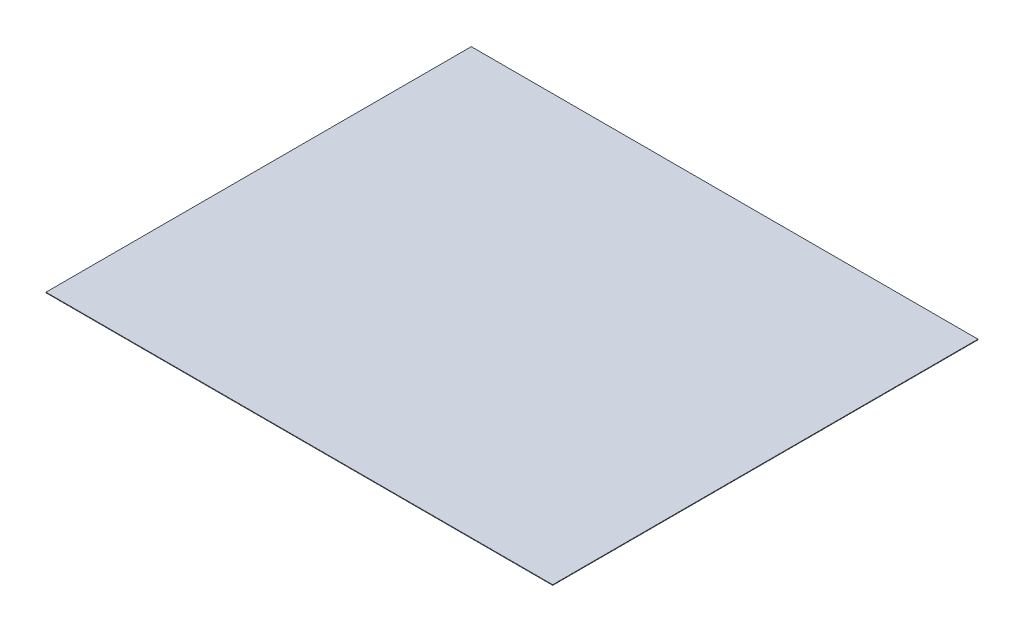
ISO-10303-21;
HEADER;
FILE_DESCRIPTION(('STEP AP214'),'2;1');
FILE_NAME('part.step','',(''),(''),'','','');
FILE_SCHEMA(('AUTOMOTIVE_DESIGN { 1 0 10303 214 1 1 1 1 }'));
ENDSEC;
DATA;
#1=APPLICATION_CONTEXT('core data for automotive mechanical design processes');
#2=APPLICATION_PROTOCOL_DEFINITION('international standard','automotive_design',2000,#1);
#3=PRODUCT_CONTEXT('',#1,'mechanical');
#4=PRODUCT('Part','Part','',(#3));
#5=PRODUCT_RELATED_PRODUCT_CATEGORY('part','',(#4));
#6=PRODUCT_DEFINITION_FORMATION('','',#4);
#7=PRODUCT_DEFINITION_CONTEXT('part definition',#1,'design');
#8=PRODUCT_DEFINITION('design','',#6,#7);
#9=PRODUCT_DEFINITION_SHAPE('','',#8);
#10=(LENGTH_UNIT() NAMED_UNIT(*) SI_UNIT(.MILLI.,.METRE.));
#11=(NAMED_UNIT(*) PLANE_ANGLE_UNIT() SI_UNIT($,.RADIAN.));
#12=(NAMED_UNIT(*) SI_UNIT($,.STERADIAN.) SOLID_ANGLE_UNIT());
#13=UNCERTAINTY_MEASURE_WITH_UNIT(LENGTH_MEASURE(1.E-05),#10,'distance_accuracy_value','');
#14=(GEOMETRIC_REPRESENTATION_CONTEXT(3) GLOBAL_UNCERTAINTY_ASSIGNED_CONTEXT((#13)) GLOBAL_UNIT_ASSIGNED_CONTEXT((#10,
#11,#12)) REPRESENTATION_CONTEXT('',''));
#15=CARTESIAN_POINT('',(0.,0.,0.));
#16=DIRECTION('',(0.,0.,1.));
#17=DIRECTION('',(1.,0.,0.));
#18=AXIS2_PLACEMENT_3D('',#15,#16,#17);
#19=CARTESIAN_POINT('',(-46547.8080775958,-100.,41093.7965483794));
#20=DIRECTION('',(-1.,0.,0.));
#21=DIRECTION('',(0.,0.,1.));
#22=AXIS2_PLACEMENT_3D('',#19,#20,#21);
#23=PLANE('',#22);
#24=DIRECTION('',(0.,0.,1.));
#25=VECTOR('',#24,1.);
#26=CARTESIAN_POINT('',(-46547.8080775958,0.,41093.7965483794));
#27=LINE('',#26,#25);
#28=CARTESIAN_POINT('',(-46547.8080775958,0.,-34760.7804493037));
#29=VERTEX_POINT('',#28);
#30=CARTESIAN_POINT('',(-46547.8080775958,0.,41093.7965483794));
#31=VERTEX_POINT('',#30);
#32=EDGE_CURVE('E103',#29,#31,#27,.T.);
#33=ORIENTED_EDGE('',*,*,#32,.F.);
#34=DIRECTION('',(0.,1.,0.));
#35=VECTOR('',#34,1.);
#36=CARTESIAN_POINT('',(-46547.8080775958,-100.,-34760.7804493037));
#37=LINE('',#36,#35);
#38=CARTESIAN_POINT('',(-46547.8080775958,-100.,-34760.7804493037));
#39=VERTEX_POINT('',#38);
#40=EDGE_CURVE('E11',#39,#29,#37,.T.);
#41=ORIENTED_EDGE('',*,*,#40,.F.);
#42=DIRECTION('',(0.,0.,1.));
#43=VECTOR('',#42,1.);
#44=CARTESIAN_POINT('',(-46547.8080775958,-100.,41093.7965483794));
#45=LINE('',#44,#43);
#46=CARTESIAN_POINT('',(-46547.8080775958,-100.,41093.7965483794));
#47=VERTEX_POINT('',#46);
#48=EDGE_CURVE('E97',#39,#47,#45,.T.);
#49=ORIENTED_EDGE('',*,*,#48,.T.);
#50=DIRECTION('',(0.,1.,0.));
#51=VECTOR('',#50,1.);
#52=CARTESIAN_POINT('',(-46547.8080775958,-100.,41093.7965483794));
#53=LINE('',#52,#51);
#54=EDGE_CURVE('E42',#47,#31,#53,.T.);
#55=ORIENTED_EDGE('',*,*,#54,.T.);
#56=EDGE_LOOP('',(#33,#41,#49,#55));
#57=FACE_BOUND('',#56,.T.);
#58=ADVANCED_FACE('F39',(#57),#23,.T.);
#59=CARTESIAN_POINT('',(-46547.8080775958,-100.,-34760.7804493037));
#60=DIRECTION('',(0.,0.,-1.));
#61=DIRECTION('',(-1.,0.,0.));
#62=AXIS2_PLACEMENT_3D('',#59,#60,#61);
#63=PLANE('',#62);
#64=DIRECTION('',(-1.,0.,0.));
#65=VECTOR('',#64,1.);
#66=CARTESIAN_POINT('',(-46547.8080775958,0.,-34760.7804493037));
#67=LINE('',#66,#65);
#68=CARTESIAN_POINT('',(43830.5373173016,0.,-34760.7804493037));
#69=VERTEX_POINT('',#68);
#70=EDGE_CURVE('E99',#69,#29,#67,.T.);
#71=ORIENTED_EDGE('',*,*,#70,.F.);
#72=DIRECTION('',(0.,1.,0.));
#73=VECTOR('',#72,1.);
#74=CARTESIAN_POINT('',(43830.5373173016,-100.,-34760.7804493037));
#75=LINE('',#74,#73);
#76=CARTESIAN_POINT('',(43830.5373173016,-100.,-34760.7804493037));
#77=VERTEX_POINT('',#76);
#78=EDGE_CURVE('E48',#77,#69,#75,.T.);
#79=ORIENTED_EDGE('',*,*,#78,.F.);
#80=DIRECTION('',(-1.,0.,0.));
#81=VECTOR('',#80,1.);
#82=CARTESIAN_POINT('',(-46547.8080775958,-100.,-34760.7804493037));
#83=LINE('',#82,#81);
#84=EDGE_CURVE('E94',#77,#39,#83,.T.);
#85=ORIENTED_EDGE('',*,*,#84,.T.);
#86=ORIENTED_EDGE('',*,*,#40,.T.);
#87=EDGE_LOOP('',(#71,#79,#85,#86));
#88=FACE_BOUND('',#87,.T.);
#89=ADVANCED_FACE('F113',(#88),#63,.T.);
#90=CARTESIAN_POINT('',(43830.5373173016,-100.,41093.7965483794));
#91=DIRECTION('',(1.,0.,0.));
#92=DIRECTION('',(0.,0.,-1.));
#93=AXIS2_PLACEMENT_3D('',#90,#91,#92);
#94=PLANE('',#93);
#95=DIRECTION('',(0.,0.,-1.));
#96=VECTOR('',#95,1.);
#97=CARTESIAN_POINT('',(43830.5373173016,0.,41093.7965483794));
#98=LINE('',#97,#96);
#99=CARTESIAN_POINT('',(43830.5373173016,0.,41093.7965483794));
#100=VERTEX_POINT('',#99);
#101=EDGE_CURVE('E89',#100,#69,#98,.T.);
#102=ORIENTED_EDGE('',*,*,#101,.F.);
#103=DIRECTION('',(0.,1.,0.));
#104=VECTOR('',#103,1.);
#105=CARTESIAN_POINT('',(43830.5373173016,-100.,41093.7965483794));
#106=LINE('',#105,#104);
#107=CARTESIAN_POINT('',(43830.5373173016,-100.,41093.7965483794));
#108=VERTEX_POINT('',#107);
#109=EDGE_CURVE('E84',#108,#100,#106,.T.);
#110=ORIENTED_EDGE('',*,*,#109,.F.);
#111=DIRECTION('',(0.,0.,-1.));
#112=VECTOR('',#111,1.);
#113=CARTESIAN_POINT('',(43830.5373173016,-100.,41093.7965483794));
#114=LINE('',#113,#112);
#115=EDGE_CURVE('E87',#108,#77,#114,.T.);
#116=ORIENTED_EDGE('',*,*,#115,.T.);
#117=ORIENTED_EDGE('',*,*,#78,.T.);
#118=EDGE_LOOP('',(#102,#110,#116,#117));
#119=FACE_BOUND('',#118,.T.);
#120=ADVANCED_FACE('F86',(#119),#94,.T.);
#121=CARTESIAN_POINT('',(-46547.8080775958,-100.,41093.7965483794));
#122=DIRECTION('',(0.,0.,1.));
#123=DIRECTION('',(1.,0.,0.));
#124=AXIS2_PLACEMENT_3D('',#121,#122,#123);
#125=PLANE('',#124);
#126=DIRECTION('',(1.,0.,0.));
#127=VECTOR('',#126,1.);
#128=CARTESIAN_POINT('',(-46547.8080775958,0.,41093.7965483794));
#129=LINE('',#128,#127);
#130=EDGE_CURVE('E106',#31,#100,#129,.T.);
#131=ORIENTED_EDGE('',*,*,#130,.F.);
#132=ORIENTED_EDGE('',*,*,#54,.F.);
#133=DIRECTION('',(1.,0.,0.));
#134=VECTOR('',#133,1.);
#135=CARTESIAN_POINT('',(-46547.8080775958,-100.,41093.7965483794));
#136=LINE('',#135,#134);
#137=EDGE_CURVE('E93',#47,#108,#136,.T.);
#138=ORIENTED_EDGE('',*,*,#137,.T.);
#139=ORIENTED_EDGE('',*,*,#109,.T.);
#140=EDGE_LOOP('',(#131,#132,#138,#139));
#141=FACE_BOUND('',#140,.T.);
#142=ADVANCED_FACE('F96',(#141),#125,.T.);
#143=CARTESIAN_POINT('',(0.,-100.,0.));
#144=DIRECTION('',(0.,-1.,0.));
#145=DIRECTION('',(0.,0.,-1.));
#146=AXIS2_PLACEMENT_3D('',#143,#144,#145);
#147=PLANE('',#146);
#148=ORIENTED_EDGE('',*,*,#48,.F.);
#149=ORIENTED_EDGE('',*,*,#84,.F.);
#150=ORIENTED_EDGE('',*,*,#115,.F.);
#151=ORIENTED_EDGE('',*,*,#137,.F.);
#152=EDGE_LOOP('',(#148,#149,#150,#151));
#153=FACE_BOUND('',#152,.T.);
#154=ADVANCED_FACE('F92',(#153),#147,.T.);
#155=CARTESIAN_POINT('',(0.,0.,0.));
#156=DIRECTION('',(0.,-1.,0.));
#157=DIRECTION('',(0.,0.,-1.));
#158=AXIS2_PLACEMENT_3D('',#155,#156,#157);
#159=PLANE('',#158);
#160=ORIENTED_EDGE('',*,*,#32,.T.);
#161=ORIENTED_EDGE('',*,*,#130,.T.);
#162=ORIENTED_EDGE('',*,*,#101,.T.);
#163=ORIENTED_EDGE('',*,*,#70,.T.);
#164=EDGE_LOOP('',(#160,#161,#162,#163));
#165=FACE_BOUND('',#164,.T.);
#166=ADVANCED_FACE('F112',(#165),#159,.F.);
#167=CLOSED_SHELL('',(#58,#89,#120,#142,#154,#166));
#168=MANIFOLD_SOLID_BREP('B2',#167);
#169=ADVANCED_BREP_SHAPE_REPRESENTATION('',(#18,#168),#14);
#170=SHAPE_DEFINITION_REPRESENTATION(#9,#169);
ENDSEC;
END-ISO-10303-21;
